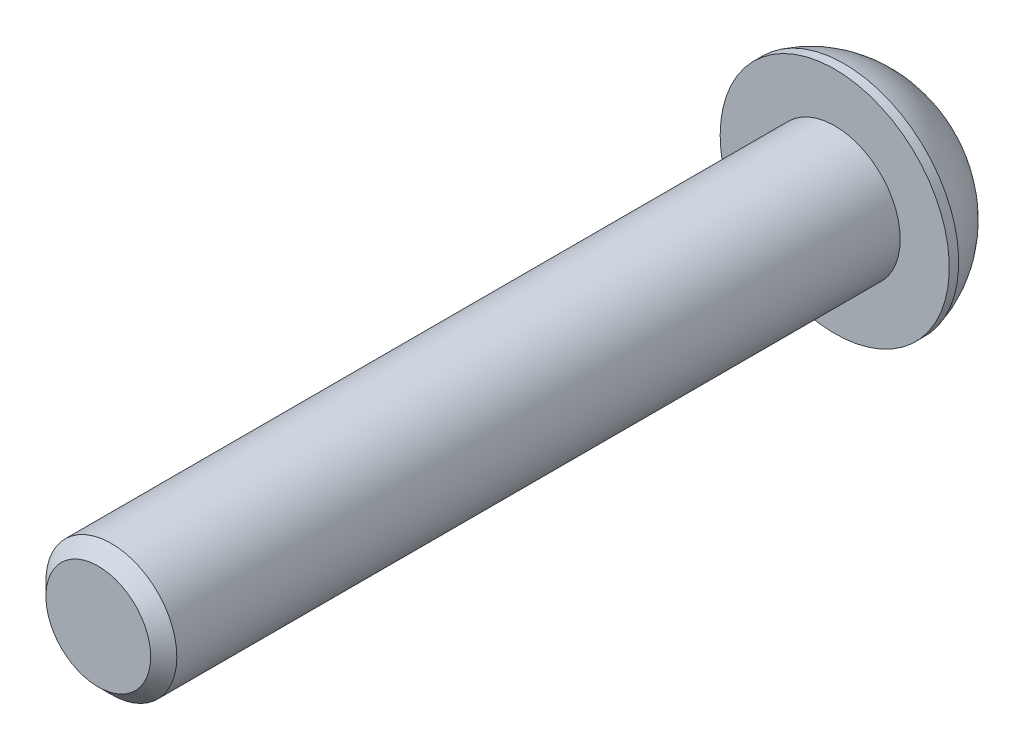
ISO-10303-21;
HEADER;
FILE_DESCRIPTION(('STEP AP214'),'2;1');
FILE_NAME('part.step','',(''),(''),'','','');
FILE_SCHEMA(('AUTOMOTIVE_DESIGN { 1 0 10303 214 1 1 1 1 }'));
ENDSEC;
DATA;
#1=APPLICATION_CONTEXT('core data for automotive mechanical design processes');
#2=APPLICATION_PROTOCOL_DEFINITION('international standard','automotive_design',2000,#1);
#3=PRODUCT_CONTEXT('',#1,'mechanical');
#4=PRODUCT('Part','Part','',(#3));
#5=PRODUCT_RELATED_PRODUCT_CATEGORY('part','',(#4));
#6=PRODUCT_DEFINITION_FORMATION('','',#4);
#7=PRODUCT_DEFINITION_CONTEXT('part definition',#1,'design');
#8=PRODUCT_DEFINITION('design','',#6,#7);
#9=PRODUCT_DEFINITION_SHAPE('','',#8);
#10=(LENGTH_UNIT() NAMED_UNIT(*) SI_UNIT(.MILLI.,.METRE.));
#11=(NAMED_UNIT(*) PLANE_ANGLE_UNIT() SI_UNIT($,.RADIAN.));
#12=(NAMED_UNIT(*) SI_UNIT($,.STERADIAN.) SOLID_ANGLE_UNIT());
#13=UNCERTAINTY_MEASURE_WITH_UNIT(LENGTH_MEASURE(1.E-05),#10,'distance_accuracy_value','');
#14=(GEOMETRIC_REPRESENTATION_CONTEXT(3) GLOBAL_UNCERTAINTY_ASSIGNED_CONTEXT((#13)) GLOBAL_UNIT_ASSIGNED_CONTEXT((#10,
#11,#12)) REPRESENTATION_CONTEXT('',''));
#15=CARTESIAN_POINT('',(0.,0.,0.));
#16=DIRECTION('',(0.,0.,1.));
#17=DIRECTION('',(1.,0.,0.));
#18=AXIS2_PLACEMENT_3D('',#15,#16,#17);
#19=CARTESIAN_POINT('',(0.,0.,-4.4));
#20=DIRECTION('',(0.,0.,1.));
#21=DIRECTION('',(1.,0.,0.));
#22=AXIS2_PLACEMENT_3D('',#19,#20,#21);
#23=PLANE('',#22);
#24=CARTESIAN_POINT('',(0.,0.,-4.4));
#25=DIRECTION('',(0.,0.,-1.));
#26=DIRECTION('',(-1.,0.,0.));
#27=AXIS2_PLACEMENT_3D('',#24,#25,#26);
#28=CIRCLE('',#27,4.06492341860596);
#29=CARTESIAN_POINT('',(-4.06492341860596,0.,-4.4));
#30=VERTEX_POINT('',#29);
#31=EDGE_CURVE('E149',#30,#30,#28,.T.);
#32=ORIENTED_EDGE('',*,*,#31,.T.);
#33=EDGE_LOOP('',(#32));
#34=FACE_BOUND('',#33,.T.);
#35=DIRECTION('',(-0.86602540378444,0.499999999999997,0.));
#36=VECTOR('',#35,1.);
#37=CARTESIAN_POINT('',(0.,2.88675134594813,-4.4));
#38=LINE('',#37,#36);
#39=CARTESIAN_POINT('',(2.5,1.44337567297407,-4.4));
#40=VERTEX_POINT('',#39);
#41=CARTESIAN_POINT('',(0.,2.88675134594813,-4.4));
#42=VERTEX_POINT('',#41);
#43=EDGE_CURVE('E51',#40,#42,#38,.T.);
#44=ORIENTED_EDGE('',*,*,#43,.T.);
#45=DIRECTION('',(-0.866025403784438,-0.500000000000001,0.));
#46=VECTOR('',#45,1.);
#47=CARTESIAN_POINT('',(0.,2.88675134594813,-4.4));
#48=LINE('',#47,#46);
#49=CARTESIAN_POINT('',(-2.5,1.44337567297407,-4.4));
#50=VERTEX_POINT('',#49);
#51=EDGE_CURVE('E122',#42,#50,#48,.T.);
#52=ORIENTED_EDGE('',*,*,#51,.T.);
#53=DIRECTION('',(0.,-1.,0.));
#54=VECTOR('',#53,1.);
#55=CARTESIAN_POINT('',(-2.5,-1.44337567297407,-4.4));
#56=LINE('',#55,#54);
#57=CARTESIAN_POINT('',(-2.5,-1.44337567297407,-4.4));
#58=VERTEX_POINT('',#57);
#59=EDGE_CURVE('E126',#50,#58,#56,.T.);
#60=ORIENTED_EDGE('',*,*,#59,.T.);
#61=DIRECTION('',(0.866025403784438,-0.500000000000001,0.));
#62=VECTOR('',#61,1.);
#63=CARTESIAN_POINT('',(0.,-2.88675134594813,-4.4));
#64=LINE('',#63,#62);
#65=CARTESIAN_POINT('',(0.,-2.88675134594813,-4.4));
#66=VERTEX_POINT('',#65);
#67=EDGE_CURVE('E129',#58,#66,#64,.T.);
#68=ORIENTED_EDGE('',*,*,#67,.T.);
#69=DIRECTION('',(0.86602540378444,0.499999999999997,0.));
#70=VECTOR('',#69,1.);
#71=CARTESIAN_POINT('',(0.,-2.88675134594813,-4.4));
#72=LINE('',#71,#70);
#73=CARTESIAN_POINT('',(2.5,-1.44337567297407,-4.4));
#74=VERTEX_POINT('',#73);
#75=EDGE_CURVE('E112',#66,#74,#72,.T.);
#76=ORIENTED_EDGE('',*,*,#75,.T.);
#77=DIRECTION('',(0.,1.,0.));
#78=VECTOR('',#77,1.);
#79=CARTESIAN_POINT('',(2.5,-1.44337567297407,-4.4));
#80=LINE('',#79,#78);
#81=EDGE_CURVE('E132',#74,#40,#80,.T.);
#82=ORIENTED_EDGE('',*,*,#81,.T.);
#83=EDGE_LOOP('',(#44,#52,#60,#68,#76,#82));
#84=FACE_BOUND('',#83,.T.);
#85=ADVANCED_FACE('F36',(#34,#84),#23,.F.);
#86=CARTESIAN_POINT('',(0.,0.,1.05548398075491));
#87=DIRECTION('',(0.,0.,-1.));
#88=DIRECTION('',(-1.,0.,0.));
#89=AXIS2_PLACEMENT_3D('',#86,#87,#88);
#90=DEGENERATE_TOROIDAL_SURFACE('',#89,0.915198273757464,6.29945028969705,.T.);
#91=ORIENTED_EDGE('',*,*,#31,.F.);
#92=EDGE_LOOP('',(#91));
#93=FACE_BOUND('',#92,.T.);
#94=CARTESIAN_POINT('',(0.,0.,-0.574933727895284));
#95=DIRECTION('',(0.,0.,-1.));
#96=DIRECTION('',(-1.,0.,0.));
#97=AXIS2_PLACEMENT_3D('',#94,#95,#96);
#98=CIRCLE('',#97,7.);
#99=CARTESIAN_POINT('',(-7.,0.,-0.574933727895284));
#100=VERTEX_POINT('',#99);
#101=EDGE_CURVE('E146',#100,#100,#98,.T.);
#102=ORIENTED_EDGE('',*,*,#101,.T.);
#103=EDGE_LOOP('',(#102));
#104=FACE_BOUND('',#103,.T.);
#105=ADVANCED_FACE('F166',(#93,#104),#90,.T.);
#106=CARTESIAN_POINT('',(0.,0.,0.));
#107=DIRECTION('',(0.,0.,-1.));
#108=DIRECTION('',(-1.,0.,0.));
#109=AXIS2_PLACEMENT_3D('',#106,#107,#108);
#110=CYLINDRICAL_SURFACE('',#109,7.);
#111=ORIENTED_EDGE('',*,*,#101,.F.);
#112=EDGE_LOOP('',(#111));
#113=FACE_BOUND('',#112,.T.);
#114=CARTESIAN_POINT('',(0.,0.,0.));
#115=DIRECTION('',(0.,0.,-1.));
#116=DIRECTION('',(-1.,0.,0.));
#117=AXIS2_PLACEMENT_3D('',#114,#115,#116);
#118=CIRCLE('',#117,7.);
#119=CARTESIAN_POINT('',(-7.,0.,0.));
#120=VERTEX_POINT('',#119);
#121=EDGE_CURVE('E143',#120,#120,#118,.T.);
#122=ORIENTED_EDGE('',*,*,#121,.T.);
#123=EDGE_LOOP('',(#122));
#124=FACE_BOUND('',#123,.T.);
#125=ADVANCED_FACE('F171',(#113,#124),#110,.T.);
#126=CARTESIAN_POINT('',(0.,0.,0.));
#127=DIRECTION('',(0.,0.,-1.));
#128=DIRECTION('',(-1.,0.,0.));
#129=AXIS2_PLACEMENT_3D('',#126,#127,#128);
#130=PLANE('',#129);
#131=CARTESIAN_POINT('',(0.,0.,0.));
#132=DIRECTION('',(0.,0.,1.));
#133=DIRECTION('',(1.,0.,0.));
#134=AXIS2_PLACEMENT_3D('',#131,#132,#133);
#135=CIRCLE('',#134,4.);
#136=CARTESIAN_POINT('',(4.,0.,0.));
#137=VERTEX_POINT('',#136);
#138=EDGE_CURVE('E123',#137,#137,#135,.T.);
#139=ORIENTED_EDGE('',*,*,#138,.F.);
#140=EDGE_LOOP('',(#139));
#141=FACE_BOUND('',#140,.T.);
#142=ORIENTED_EDGE('',*,*,#121,.F.);
#143=EDGE_LOOP('',(#142));
#144=FACE_BOUND('',#143,.T.);
#145=ADVANCED_FACE('F178',(#141,#144),#130,.F.);
#146=CARTESIAN_POINT('',(0.,2.88675134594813,-1.8));
#147=DIRECTION('',(-0.499999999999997,-0.86602540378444,0.));
#148=DIRECTION('',(0.86602540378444,-0.499999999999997,0.));
#149=AXIS2_PLACEMENT_3D('',#146,#147,#148);
#150=PLANE('',#149);
#151=ORIENTED_EDGE('',*,*,#43,.F.);
#152=DIRECTION('',(0.,0.,-1.));
#153=VECTOR('',#152,1.);
#154=CARTESIAN_POINT('',(2.5,1.44337567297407,-1.8));
#155=LINE('',#154,#153);
#156=CARTESIAN_POINT('',(2.5,1.44337567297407,-1.8));
#157=VERTEX_POINT('',#156);
#158=EDGE_CURVE('E117',#157,#40,#155,.T.);
#159=ORIENTED_EDGE('',*,*,#158,.F.);
#160=DIRECTION('',(-0.86602540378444,0.499999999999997,0.));
#161=VECTOR('',#160,1.);
#162=CARTESIAN_POINT('',(0.,2.88675134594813,-1.8));
#163=LINE('',#162,#161);
#164=CARTESIAN_POINT('',(0.,2.88675134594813,-1.8));
#165=VERTEX_POINT('',#164);
#166=EDGE_CURVE('E135',#157,#165,#163,.T.);
#167=ORIENTED_EDGE('',*,*,#166,.T.);
#168=DIRECTION('',(0.,0.,-1.));
#169=VECTOR('',#168,1.);
#170=CARTESIAN_POINT('',(0.,2.88675134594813,-1.8));
#171=LINE('',#170,#169);
#172=EDGE_CURVE('E141',#165,#42,#171,.T.);
#173=ORIENTED_EDGE('',*,*,#172,.T.);
#174=EDGE_LOOP('',(#151,#159,#167,#173));
#175=FACE_BOUND('',#174,.T.);
#176=ADVANCED_FACE('F182',(#175),#150,.T.);
#177=CARTESIAN_POINT('',(0.,2.88675134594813,-1.8));
#178=DIRECTION('',(0.500000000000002,-0.866025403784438,0.));
#179=DIRECTION('',(0.866025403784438,0.500000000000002,0.));
#180=AXIS2_PLACEMENT_3D('',#177,#178,#179);
#181=PLANE('',#180);
#182=ORIENTED_EDGE('',*,*,#51,.F.);
#183=ORIENTED_EDGE('',*,*,#172,.F.);
#184=DIRECTION('',(-0.866025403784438,-0.500000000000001,0.));
#185=VECTOR('',#184,1.);
#186=CARTESIAN_POINT('',(0.,2.88675134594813,-1.8));
#187=LINE('',#186,#185);
#188=CARTESIAN_POINT('',(-2.5,1.44337567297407,-1.8));
#189=VERTEX_POINT('',#188);
#190=EDGE_CURVE('E90',#165,#189,#187,.T.);
#191=ORIENTED_EDGE('',*,*,#190,.T.);
#192=DIRECTION('',(0.,0.,-1.));
#193=VECTOR('',#192,1.);
#194=CARTESIAN_POINT('',(-2.5,1.44337567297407,-1.8));
#195=LINE('',#194,#193);
#196=EDGE_CURVE('E139',#189,#50,#195,.T.);
#197=ORIENTED_EDGE('',*,*,#196,.T.);
#198=EDGE_LOOP('',(#182,#183,#191,#197));
#199=FACE_BOUND('',#198,.T.);
#200=ADVANCED_FACE('F186',(#199),#181,.T.);
#201=CARTESIAN_POINT('',(-2.5,-1.44337567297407,-1.8));
#202=DIRECTION('',(1.,0.,0.));
#203=DIRECTION('',(0.,0.,-1.));
#204=AXIS2_PLACEMENT_3D('',#201,#202,#203);
#205=PLANE('',#204);
#206=ORIENTED_EDGE('',*,*,#59,.F.);
#207=ORIENTED_EDGE('',*,*,#196,.F.);
#208=DIRECTION('',(0.,-1.,0.));
#209=VECTOR('',#208,1.);
#210=CARTESIAN_POINT('',(-2.5,-1.44337567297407,-1.8));
#211=LINE('',#210,#209);
#212=CARTESIAN_POINT('',(-2.5,-1.44337567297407,-1.8));
#213=VERTEX_POINT('',#212);
#214=EDGE_CURVE('E108',#189,#213,#211,.T.);
#215=ORIENTED_EDGE('',*,*,#214,.T.);
#216=DIRECTION('',(0.,0.,-1.));
#217=VECTOR('',#216,1.);
#218=CARTESIAN_POINT('',(-2.5,-1.44337567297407,-1.8));
#219=LINE('',#218,#217);
#220=EDGE_CURVE('E105',#213,#58,#219,.T.);
#221=ORIENTED_EDGE('',*,*,#220,.T.);
#222=EDGE_LOOP('',(#206,#207,#215,#221));
#223=FACE_BOUND('',#222,.T.);
#224=ADVANCED_FACE('F189',(#223),#205,.T.);
#225=CARTESIAN_POINT('',(0.,-2.88675134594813,-1.8));
#226=DIRECTION('',(0.500000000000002,0.866025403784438,0.));
#227=DIRECTION('',(-0.866025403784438,0.500000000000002,0.));
#228=AXIS2_PLACEMENT_3D('',#225,#226,#227);
#229=PLANE('',#228);
#230=ORIENTED_EDGE('',*,*,#67,.F.);
#231=ORIENTED_EDGE('',*,*,#220,.F.);
#232=DIRECTION('',(0.866025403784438,-0.500000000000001,0.));
#233=VECTOR('',#232,1.);
#234=CARTESIAN_POINT('',(0.,-2.88675134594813,-1.8));
#235=LINE('',#234,#233);
#236=CARTESIAN_POINT('',(0.,-2.88675134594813,-1.8));
#237=VERTEX_POINT('',#236);
#238=EDGE_CURVE('E100',#213,#237,#235,.T.);
#239=ORIENTED_EDGE('',*,*,#238,.T.);
#240=DIRECTION('',(0.,0.,-1.));
#241=VECTOR('',#240,1.);
#242=CARTESIAN_POINT('',(0.,-2.88675134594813,-1.8));
#243=LINE('',#242,#241);
#244=EDGE_CURVE('E104',#237,#66,#243,.T.);
#245=ORIENTED_EDGE('',*,*,#244,.T.);
#246=EDGE_LOOP('',(#230,#231,#239,#245));
#247=FACE_BOUND('',#246,.T.);
#248=ADVANCED_FACE('F103',(#247),#229,.T.);
#249=CARTESIAN_POINT('',(0.,-2.88675134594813,-1.8));
#250=DIRECTION('',(-0.499999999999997,0.86602540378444,0.));
#251=DIRECTION('',(-0.86602540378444,-0.499999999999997,0.));
#252=AXIS2_PLACEMENT_3D('',#249,#250,#251);
#253=PLANE('',#252);
#254=ORIENTED_EDGE('',*,*,#75,.F.);
#255=ORIENTED_EDGE('',*,*,#244,.F.);
#256=DIRECTION('',(0.86602540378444,0.499999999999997,0.));
#257=VECTOR('',#256,1.);
#258=CARTESIAN_POINT('',(0.,-2.88675134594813,-1.8));
#259=LINE('',#258,#257);
#260=CARTESIAN_POINT('',(2.5,-1.44337567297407,-1.8));
#261=VERTEX_POINT('',#260);
#262=EDGE_CURVE('E107',#237,#261,#259,.T.);
#263=ORIENTED_EDGE('',*,*,#262,.T.);
#264=DIRECTION('',(0.,0.,-1.));
#265=VECTOR('',#264,1.);
#266=CARTESIAN_POINT('',(2.5,-1.44337567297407,-1.8));
#267=LINE('',#266,#265);
#268=EDGE_CURVE('E81',#261,#74,#267,.T.);
#269=ORIENTED_EDGE('',*,*,#268,.T.);
#270=EDGE_LOOP('',(#254,#255,#263,#269));
#271=FACE_BOUND('',#270,.T.);
#272=ADVANCED_FACE('F110',(#271),#253,.T.);
#273=CARTESIAN_POINT('',(2.5,-1.44337567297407,-1.8));
#274=DIRECTION('',(-1.,0.,0.));
#275=DIRECTION('',(0.,0.,1.));
#276=AXIS2_PLACEMENT_3D('',#273,#274,#275);
#277=PLANE('',#276);
#278=ORIENTED_EDGE('',*,*,#81,.F.);
#279=ORIENTED_EDGE('',*,*,#268,.F.);
#280=DIRECTION('',(0.,1.,0.));
#281=VECTOR('',#280,1.);
#282=CARTESIAN_POINT('',(2.5,-1.44337567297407,-1.8));
#283=LINE('',#282,#281);
#284=EDGE_CURVE('E59',#261,#157,#283,.T.);
#285=ORIENTED_EDGE('',*,*,#284,.T.);
#286=ORIENTED_EDGE('',*,*,#158,.T.);
#287=EDGE_LOOP('',(#278,#279,#285,#286));
#288=FACE_BOUND('',#287,.T.);
#289=ADVANCED_FACE('F198',(#288),#277,.T.);
#290=CARTESIAN_POINT('',(2.5,1.44337567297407,-1.8));
#291=DIRECTION('',(0.,0.,1.));
#292=DIRECTION('',(1.,0.,0.));
#293=AXIS2_PLACEMENT_3D('',#290,#291,#292);
#294=PLANE('',#293);
#295=ORIENTED_EDGE('',*,*,#166,.F.);
#296=ORIENTED_EDGE('',*,*,#284,.F.);
#297=ORIENTED_EDGE('',*,*,#262,.F.);
#298=ORIENTED_EDGE('',*,*,#238,.F.);
#299=ORIENTED_EDGE('',*,*,#214,.F.);
#300=ORIENTED_EDGE('',*,*,#190,.F.);
#301=EDGE_LOOP('',(#295,#296,#297,#298,#299,#300));
#302=FACE_BOUND('',#301,.T.);
#303=ADVANCED_FACE('F115',(#302),#294,.F.);
#304=CARTESIAN_POINT('',(0.,0.,45.));
#305=DIRECTION('',(0.,0.,1.));
#306=DIRECTION('',(1.,0.,0.));
#307=AXIS2_PLACEMENT_3D('',#304,#305,#306);
#308=PLANE('',#307);
#309=CARTESIAN_POINT('',(0.,0.,45.));
#310=DIRECTION('',(0.,0.,1.));
#311=DIRECTION('',(1.,0.,0.));
#312=AXIS2_PLACEMENT_3D('',#309,#310,#311);
#313=CIRCLE('',#312,3.2);
#314=CARTESIAN_POINT('',(3.20000000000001,0.,45.));
#315=VERTEX_POINT('',#314);
#316=EDGE_CURVE('E44',#315,#315,#313,.T.);
#317=ORIENTED_EDGE('',*,*,#316,.T.);
#318=EDGE_LOOP('',(#317));
#319=FACE_BOUND('',#318,.T.);
#320=ADVANCED_FACE('F154',(#319),#308,.T.);
#321=CARTESIAN_POINT('',(0.,0.,0.));
#322=DIRECTION('',(0.,0.,1.));
#323=DIRECTION('',(1.,0.,0.));
#324=AXIS2_PLACEMENT_3D('',#321,#322,#323);
#325=CYLINDRICAL_SURFACE('',#324,4.);
#326=CARTESIAN_POINT('',(0.,0.,44.2));
#327=DIRECTION('',(0.,0.,1.));
#328=DIRECTION('',(1.,0.,0.));
#329=AXIS2_PLACEMENT_3D('',#326,#327,#328);
#330=CIRCLE('',#329,4.);
#331=CARTESIAN_POINT('',(4.00000000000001,0.,44.2));
#332=VERTEX_POINT('',#331);
#333=EDGE_CURVE('E11',#332,#332,#330,.F.);
#334=ORIENTED_EDGE('',*,*,#333,.T.);
#335=EDGE_LOOP('',(#334));
#336=FACE_BOUND('',#335,.T.);
#337=ORIENTED_EDGE('',*,*,#138,.T.);
#338=EDGE_LOOP('',(#337));
#339=FACE_BOUND('',#338,.T.);
#340=ADVANCED_FACE('F157',(#336,#339),#325,.T.);
#341=CARTESIAN_POINT('',(0.,0.,45.));
#342=DIRECTION('',(0.,0.,-1.));
#343=DIRECTION('',(-1.,0.,0.));
#344=AXIS2_PLACEMENT_3D('',#341,#342,#343);
#345=CONICAL_SURFACE('',#344,3.2,0.785398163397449);
#346=ORIENTED_EDGE('',*,*,#333,.F.);
#347=EDGE_LOOP('',(#346));
#348=FACE_BOUND('',#347,.T.);
#349=ORIENTED_EDGE('',*,*,#316,.F.);
#350=EDGE_LOOP('',(#349));
#351=FACE_BOUND('',#350,.T.);
#352=ADVANCED_FACE('F38',(#348,#351),#345,.T.);
#353=CLOSED_SHELL('',(#85,#105,#125,#145,#176,#200,#224,#248,#272,#289,#303,#320,#340,#352));
#354=MANIFOLD_SOLID_BREP('B2',#353);
#355=ADVANCED_BREP_SHAPE_REPRESENTATION('',(#18,#354),#14);
#356=SHAPE_DEFINITION_REPRESENTATION(#9,#355);
ENDSEC;
END-ISO-10303-21;
